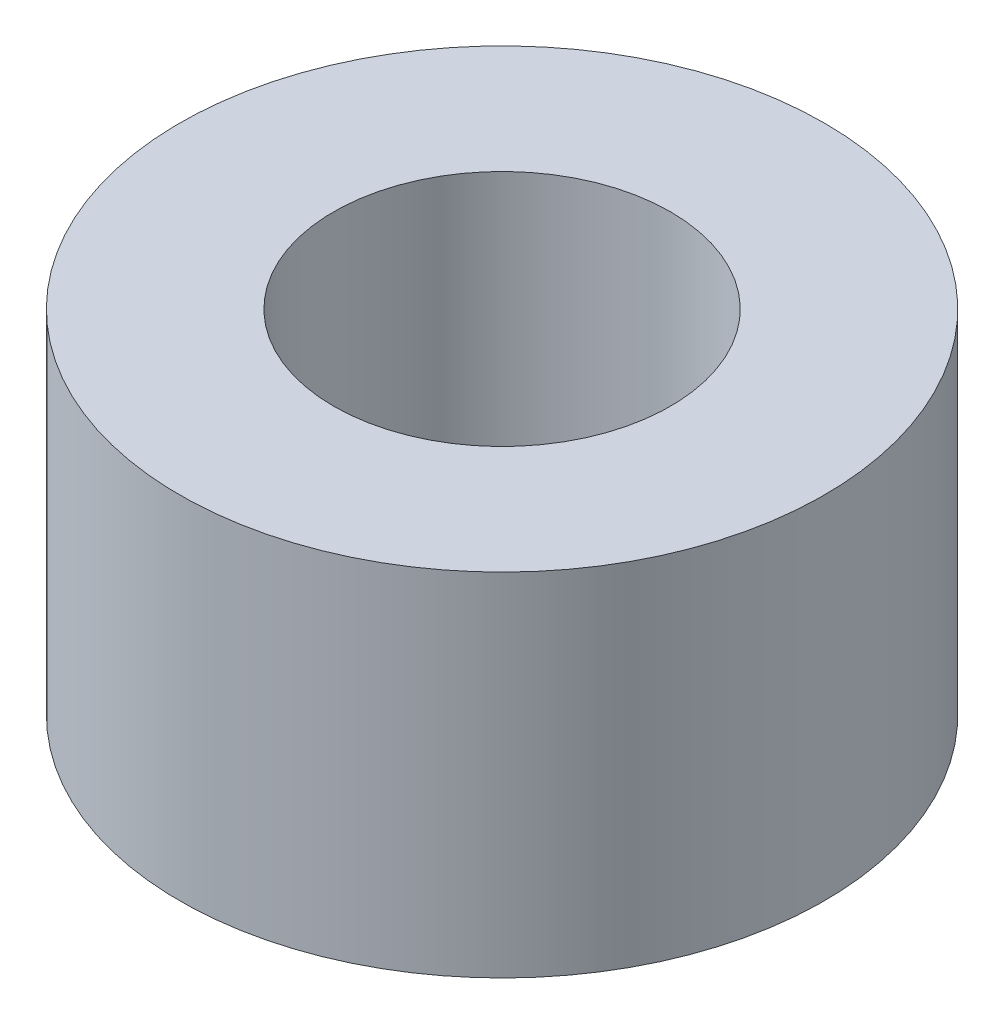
from build123d import *

# Parameters (mm, degrees)
SKETCH1_R                        = 17.4625
BOSS_EXTRUDE1_DEPTH              = 19.05
F_23_32_0_71875_DIAMETER_HOLE1_D = 18.25625


with BuildPart() as part:
    # Sketch1 → Boss-Extrude1 (new body)
    with BuildSketch(Plane(origin=(0, 0, 0), x_dir=(1, 0, 0), z_dir=(0, 1, 0))):
        with Locations(Location((0, 0, 0), (0, 0, 90))):
            Circle(SKETCH1_R)
    extrude(amount=BOSS_EXTRUDE1_DEPTH)

    # 23_32 _0.71875_ Diameter Hole1 (through all)
    with Locations(Plane(origin=(0, 19.05, 0), x_dir=(-1, 0, 0), z_dir=(0, 1, 0))):
        with Locations((0, 0)):
            Hole(F_23_32_0_71875_DIAMETER_HOLE1_D / 2)


solid = part.part
